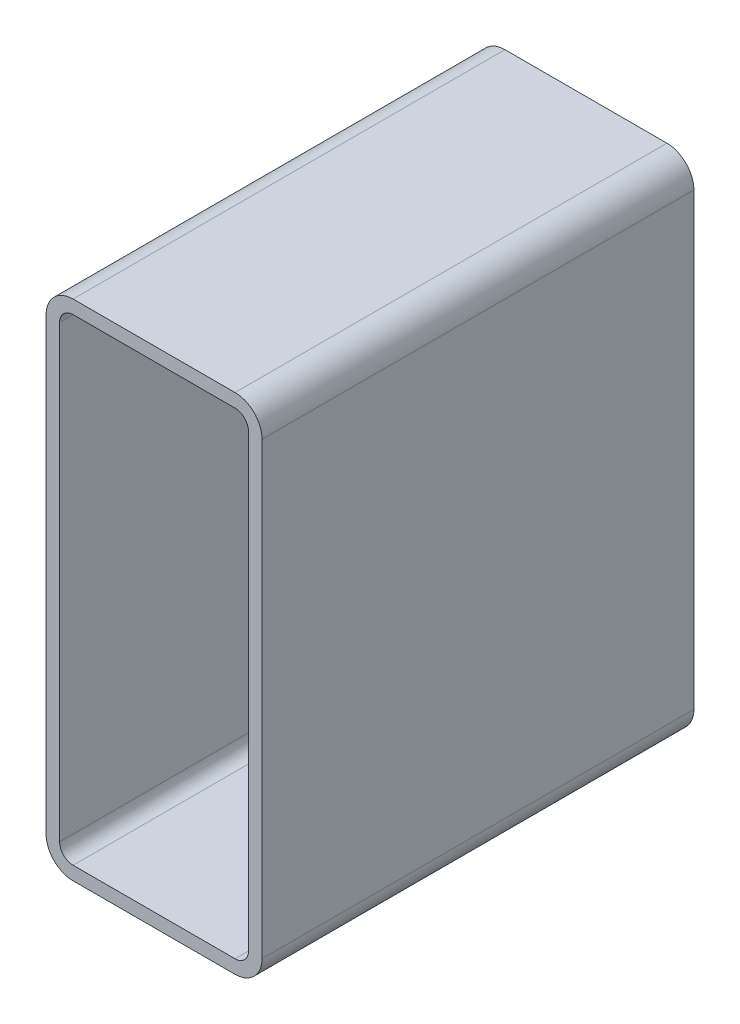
ISO-10303-21;
HEADER;
FILE_DESCRIPTION(('STEP AP214'),'2;1');
FILE_NAME('part.step','',(''),(''),'','','');
FILE_SCHEMA(('AUTOMOTIVE_DESIGN { 1 0 10303 214 1 1 1 1 }'));
ENDSEC;
DATA;
#1=APPLICATION_CONTEXT('core data for automotive mechanical design processes');
#2=APPLICATION_PROTOCOL_DEFINITION('international standard','automotive_design',2000,#1);
#3=PRODUCT_CONTEXT('',#1,'mechanical');
#4=PRODUCT('Part','Part','',(#3));
#5=PRODUCT_RELATED_PRODUCT_CATEGORY('part','',(#4));
#6=PRODUCT_DEFINITION_FORMATION('','',#4);
#7=PRODUCT_DEFINITION_CONTEXT('part definition',#1,'design');
#8=PRODUCT_DEFINITION('design','',#6,#7);
#9=PRODUCT_DEFINITION_SHAPE('','',#8);
#10=(LENGTH_UNIT() NAMED_UNIT(*) SI_UNIT(.MILLI.,.METRE.));
#11=(NAMED_UNIT(*) PLANE_ANGLE_UNIT() SI_UNIT($,.RADIAN.));
#12=(NAMED_UNIT(*) SI_UNIT($,.STERADIAN.) SOLID_ANGLE_UNIT());
#13=UNCERTAINTY_MEASURE_WITH_UNIT(LENGTH_MEASURE(1.E-05),#10,'distance_accuracy_value','');
#14=(GEOMETRIC_REPRESENTATION_CONTEXT(3) GLOBAL_UNCERTAINTY_ASSIGNED_CONTEXT((#13)) GLOBAL_UNIT_ASSIGNED_CONTEXT((#10,
#11,#12)) REPRESENTATION_CONTEXT('',''));
#15=CARTESIAN_POINT('',(0.,0.,0.));
#16=DIRECTION('',(0.,0.,1.));
#17=DIRECTION('',(1.,0.,0.));
#18=AXIS2_PLACEMENT_3D('',#15,#16,#17);
#19=CARTESIAN_POINT('',(19.0973013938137,338.378679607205,304.8));
#20=DIRECTION('',(0.,0.,1.));
#21=DIRECTION('',(1.,0.,0.));
#22=AXIS2_PLACEMENT_3D('',#19,#20,#21);
#23=PLANE('',#22);
#24=CARTESIAN_POINT('',(19.0973013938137,338.378679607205,304.8));
#25=DIRECTION('',(0.,0.,1.));
#26=DIRECTION('',(1.,0.,0.));
#27=AXIS2_PLACEMENT_3D('',#24,#25,#26);
#28=CIRCLE('',#27,19.05);
#29=CARTESIAN_POINT('',(19.0973013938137,357.428679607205,304.8));
#30=VERTEX_POINT('',#29);
#31=CARTESIAN_POINT('',(0.0473013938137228,338.378679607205,304.8));
#32=VERTEX_POINT('',#31);
#33=EDGE_CURVE('E211',#30,#32,#28,.T.);
#34=ORIENTED_EDGE('',*,*,#33,.T.);
#35=DIRECTION('',(0.,-1.,0.));
#36=VECTOR('',#35,1.);
#37=CARTESIAN_POINT('',(0.0473013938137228,20.8786796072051,304.8));
#38=LINE('',#37,#36);
#39=CARTESIAN_POINT('',(0.0473013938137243,20.8786796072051,304.8));
#40=VERTEX_POINT('',#39);
#41=EDGE_CURVE('E214',#32,#40,#38,.T.);
#42=ORIENTED_EDGE('',*,*,#41,.T.);
#43=CARTESIAN_POINT('',(19.0973013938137,20.8786796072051,304.8));
#44=DIRECTION('',(0.,0.,1.));
#45=DIRECTION('',(1.,0.,0.));
#46=AXIS2_PLACEMENT_3D('',#43,#44,#45);
#47=CIRCLE('',#46,19.05);
#48=CARTESIAN_POINT('',(19.0973013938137,1.82867960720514,304.8));
#49=VERTEX_POINT('',#48);
#50=EDGE_CURVE('E217',#40,#49,#47,.T.);
#51=ORIENTED_EDGE('',*,*,#50,.T.);
#52=DIRECTION('',(1.,0.,0.));
#53=VECTOR('',#52,1.);
#54=CARTESIAN_POINT('',(133.397301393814,1.82867960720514,304.8));
#55=LINE('',#54,#53);
#56=CARTESIAN_POINT('',(133.397301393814,1.82867960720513,304.8));
#57=VERTEX_POINT('',#56);
#58=EDGE_CURVE('E219',#49,#57,#55,.T.);
#59=ORIENTED_EDGE('',*,*,#58,.T.);
#60=CARTESIAN_POINT('',(133.397301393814,20.8786796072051,304.8));
#61=DIRECTION('',(0.,0.,1.));
#62=DIRECTION('',(1.,0.,0.));
#63=AXIS2_PLACEMENT_3D('',#60,#61,#62);
#64=CIRCLE('',#63,19.05);
#65=CARTESIAN_POINT('',(152.447301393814,20.8786796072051,304.8));
#66=VERTEX_POINT('',#65);
#67=EDGE_CURVE('E221',#57,#66,#64,.T.);
#68=ORIENTED_EDGE('',*,*,#67,.T.);
#69=DIRECTION('',(0.,1.,0.));
#70=VECTOR('',#69,1.);
#71=CARTESIAN_POINT('',(152.447301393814,338.378679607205,304.8));
#72=LINE('',#71,#70);
#73=CARTESIAN_POINT('',(152.447301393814,338.378679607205,304.8));
#74=VERTEX_POINT('',#73);
#75=EDGE_CURVE('E223',#66,#74,#72,.T.);
#76=ORIENTED_EDGE('',*,*,#75,.T.);
#77=CARTESIAN_POINT('',(133.397301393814,338.378679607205,304.8));
#78=DIRECTION('',(0.,0.,1.));
#79=DIRECTION('',(1.,0.,0.));
#80=AXIS2_PLACEMENT_3D('',#77,#78,#79);
#81=CIRCLE('',#80,19.05);
#82=CARTESIAN_POINT('',(133.397301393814,357.428679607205,304.8));
#83=VERTEX_POINT('',#82);
#84=EDGE_CURVE('E225',#74,#83,#81,.T.);
#85=ORIENTED_EDGE('',*,*,#84,.T.);
#86=DIRECTION('',(-1.,0.,0.));
#87=VECTOR('',#86,1.);
#88=CARTESIAN_POINT('',(19.0973013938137,357.428679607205,304.8));
#89=LINE('',#88,#87);
#90=EDGE_CURVE('E227',#83,#30,#89,.T.);
#91=ORIENTED_EDGE('',*,*,#90,.T.);
#92=EDGE_LOOP('',(#34,#42,#51,#59,#68,#76,#85,#91));
#93=FACE_BOUND('',#92,.T.);
#94=DIRECTION('',(0.,-1.,0.));
#95=VECTOR('',#94,1.);
#96=CARTESIAN_POINT('',(9.57230139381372,20.8786796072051,304.8));
#97=LINE('',#96,#95);
#98=CARTESIAN_POINT('',(9.57230139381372,338.378679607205,304.8));
#99=VERTEX_POINT('',#98);
#100=CARTESIAN_POINT('',(9.57230139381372,20.8786796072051,304.8));
#101=VERTEX_POINT('',#100);
#102=EDGE_CURVE('E154',#99,#101,#97,.T.);
#103=ORIENTED_EDGE('',*,*,#102,.F.);
#104=CARTESIAN_POINT('',(19.0973013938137,338.378679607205,304.8));
#105=DIRECTION('',(0.,0.,1.));
#106=DIRECTION('',(1.,0.,0.));
#107=AXIS2_PLACEMENT_3D('',#104,#105,#106);
#108=CIRCLE('',#107,9.52499999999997);
#109=CARTESIAN_POINT('',(19.0973013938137,347.903679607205,304.8));
#110=VERTEX_POINT('',#109);
#111=EDGE_CURVE('E146',#110,#99,#108,.T.);
#112=ORIENTED_EDGE('',*,*,#111,.F.);
#113=DIRECTION('',(-1.,0.,0.));
#114=VECTOR('',#113,1.);
#115=CARTESIAN_POINT('',(19.0973013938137,347.903679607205,304.8));
#116=LINE('',#115,#114);
#117=CARTESIAN_POINT('',(133.397301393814,347.903679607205,304.8));
#118=VERTEX_POINT('',#117);
#119=EDGE_CURVE('E179',#118,#110,#116,.T.);
#120=ORIENTED_EDGE('',*,*,#119,.F.);
#121=CARTESIAN_POINT('',(133.397301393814,338.378679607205,304.8));
#122=DIRECTION('',(0.,0.,1.));
#123=DIRECTION('',(1.,0.,0.));
#124=AXIS2_PLACEMENT_3D('',#121,#122,#123);
#125=CIRCLE('',#124,9.52499999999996);
#126=CARTESIAN_POINT('',(142.922301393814,338.378679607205,304.8));
#127=VERTEX_POINT('',#126);
#128=EDGE_CURVE('E177',#127,#118,#125,.T.);
#129=ORIENTED_EDGE('',*,*,#128,.F.);
#130=DIRECTION('',(0.,1.,0.));
#131=VECTOR('',#130,1.);
#132=CARTESIAN_POINT('',(142.922301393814,338.378679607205,304.8));
#133=LINE('',#132,#131);
#134=CARTESIAN_POINT('',(142.922301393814,20.8786796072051,304.8));
#135=VERTEX_POINT('',#134);
#136=EDGE_CURVE('E175',#135,#127,#133,.T.);
#137=ORIENTED_EDGE('',*,*,#136,.F.);
#138=CARTESIAN_POINT('',(133.397301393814,20.8786796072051,304.8));
#139=DIRECTION('',(0.,0.,1.));
#140=DIRECTION('',(1.,0.,0.));
#141=AXIS2_PLACEMENT_3D('',#138,#139,#140);
#142=CIRCLE('',#141,9.525);
#143=CARTESIAN_POINT('',(133.397301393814,11.3536796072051,304.8));
#144=VERTEX_POINT('',#143);
#145=EDGE_CURVE('E173',#144,#135,#142,.T.);
#146=ORIENTED_EDGE('',*,*,#145,.F.);
#147=DIRECTION('',(1.,0.,0.));
#148=VECTOR('',#147,1.);
#149=CARTESIAN_POINT('',(133.397301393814,11.3536796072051,304.8));
#150=LINE('',#149,#148);
#151=CARTESIAN_POINT('',(19.0973013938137,11.3536796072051,304.8));
#152=VERTEX_POINT('',#151);
#153=EDGE_CURVE('E169',#152,#144,#150,.T.);
#154=ORIENTED_EDGE('',*,*,#153,.F.);
#155=CARTESIAN_POINT('',(19.0973013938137,20.8786796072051,304.8));
#156=DIRECTION('',(0.,0.,1.));
#157=DIRECTION('',(1.,0.,0.));
#158=AXIS2_PLACEMENT_3D('',#155,#156,#157);
#159=CIRCLE('',#158,9.525);
#160=EDGE_CURVE('E167',#101,#152,#159,.T.);
#161=ORIENTED_EDGE('',*,*,#160,.F.);
#162=EDGE_LOOP('',(#103,#112,#120,#129,#137,#146,#154,#161));
#163=FACE_BOUND('',#162,.T.);
#164=ADVANCED_FACE('F33',(#93,#163),#23,.T.);
#165=CARTESIAN_POINT('',(19.0973013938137,338.378679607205,0.));
#166=DIRECTION('',(0.,0.,1.));
#167=DIRECTION('',(1.,0.,0.));
#168=AXIS2_PLACEMENT_3D('',#165,#166,#167);
#169=PLANE('',#168);
#170=CARTESIAN_POINT('',(19.0973013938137,338.378679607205,0.));
#171=DIRECTION('',(0.,0.,1.));
#172=DIRECTION('',(1.,0.,0.));
#173=AXIS2_PLACEMENT_3D('',#170,#171,#172);
#174=CIRCLE('',#173,19.05);
#175=CARTESIAN_POINT('',(19.0973013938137,357.428679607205,0.));
#176=VERTEX_POINT('',#175);
#177=CARTESIAN_POINT('',(0.0473013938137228,338.378679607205,0.));
#178=VERTEX_POINT('',#177);
#179=EDGE_CURVE('E162',#176,#178,#174,.T.);
#180=ORIENTED_EDGE('',*,*,#179,.F.);
#181=DIRECTION('',(-1.,0.,0.));
#182=VECTOR('',#181,1.);
#183=CARTESIAN_POINT('',(19.0973013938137,357.428679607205,0.));
#184=LINE('',#183,#182);
#185=CARTESIAN_POINT('',(133.397301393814,357.428679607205,0.));
#186=VERTEX_POINT('',#185);
#187=EDGE_CURVE('E215',#186,#176,#184,.T.);
#188=ORIENTED_EDGE('',*,*,#187,.F.);
#189=CARTESIAN_POINT('',(133.397301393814,338.378679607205,0.));
#190=DIRECTION('',(0.,0.,1.));
#191=DIRECTION('',(1.,0.,0.));
#192=AXIS2_PLACEMENT_3D('',#189,#190,#191);
#193=CIRCLE('',#192,19.05);
#194=CARTESIAN_POINT('',(152.447301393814,338.378679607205,0.));
#195=VERTEX_POINT('',#194);
#196=EDGE_CURVE('E242',#195,#186,#193,.T.);
#197=ORIENTED_EDGE('',*,*,#196,.F.);
#198=DIRECTION('',(0.,1.,0.));
#199=VECTOR('',#198,1.);
#200=CARTESIAN_POINT('',(152.447301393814,338.378679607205,0.));
#201=LINE('',#200,#199);
#202=CARTESIAN_POINT('',(152.447301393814,20.8786796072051,0.));
#203=VERTEX_POINT('',#202);
#204=EDGE_CURVE('E240',#203,#195,#201,.T.);
#205=ORIENTED_EDGE('',*,*,#204,.F.);
#206=CARTESIAN_POINT('',(133.397301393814,20.8786796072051,0.));
#207=DIRECTION('',(0.,0.,1.));
#208=DIRECTION('',(1.,0.,0.));
#209=AXIS2_PLACEMENT_3D('',#206,#207,#208);
#210=CIRCLE('',#209,19.05);
#211=CARTESIAN_POINT('',(133.397301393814,1.82867960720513,0.));
#212=VERTEX_POINT('',#211);
#213=EDGE_CURVE('E238',#212,#203,#210,.T.);
#214=ORIENTED_EDGE('',*,*,#213,.F.);
#215=DIRECTION('',(1.,0.,0.));
#216=VECTOR('',#215,1.);
#217=CARTESIAN_POINT('',(133.397301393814,1.82867960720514,0.));
#218=LINE('',#217,#216);
#219=CARTESIAN_POINT('',(19.0973013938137,1.82867960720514,0.));
#220=VERTEX_POINT('',#219);
#221=EDGE_CURVE('E236',#220,#212,#218,.T.);
#222=ORIENTED_EDGE('',*,*,#221,.F.);
#223=CARTESIAN_POINT('',(19.0973013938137,20.8786796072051,0.));
#224=DIRECTION('',(0.,0.,1.));
#225=DIRECTION('',(1.,0.,0.));
#226=AXIS2_PLACEMENT_3D('',#223,#224,#225);
#227=CIRCLE('',#226,19.05);
#228=CARTESIAN_POINT('',(0.0473013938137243,20.8786796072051,0.));
#229=VERTEX_POINT('',#228);
#230=EDGE_CURVE('E234',#229,#220,#227,.T.);
#231=ORIENTED_EDGE('',*,*,#230,.F.);
#232=DIRECTION('',(0.,-1.,0.));
#233=VECTOR('',#232,1.);
#234=CARTESIAN_POINT('',(0.0473013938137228,20.8786796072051,0.));
#235=LINE('',#234,#233);
#236=EDGE_CURVE('E232',#178,#229,#235,.T.);
#237=ORIENTED_EDGE('',*,*,#236,.F.);
#238=EDGE_LOOP('',(#180,#188,#197,#205,#214,#222,#231,#237));
#239=FACE_BOUND('',#238,.T.);
#240=CARTESIAN_POINT('',(19.0973013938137,338.378679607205,0.));
#241=DIRECTION('',(0.,0.,1.));
#242=DIRECTION('',(1.,0.,0.));
#243=AXIS2_PLACEMENT_3D('',#240,#241,#242);
#244=CIRCLE('',#243,9.52499999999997);
#245=CARTESIAN_POINT('',(19.0973013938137,347.903679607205,0.));
#246=VERTEX_POINT('',#245);
#247=CARTESIAN_POINT('',(9.57230139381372,338.378679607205,0.));
#248=VERTEX_POINT('',#247);
#249=EDGE_CURVE('E56',#246,#248,#244,.T.);
#250=ORIENTED_EDGE('',*,*,#249,.T.);
#251=DIRECTION('',(0.,-1.,0.));
#252=VECTOR('',#251,1.);
#253=CARTESIAN_POINT('',(9.57230139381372,20.8786796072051,0.));
#254=LINE('',#253,#252);
#255=CARTESIAN_POINT('',(9.57230139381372,20.8786796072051,0.));
#256=VERTEX_POINT('',#255);
#257=EDGE_CURVE('E161',#248,#256,#254,.T.);
#258=ORIENTED_EDGE('',*,*,#257,.T.);
#259=CARTESIAN_POINT('',(19.0973013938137,20.8786796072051,0.));
#260=DIRECTION('',(0.,0.,1.));
#261=DIRECTION('',(1.,0.,0.));
#262=AXIS2_PLACEMENT_3D('',#259,#260,#261);
#263=CIRCLE('',#262,9.525);
#264=CARTESIAN_POINT('',(19.0973013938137,11.3536796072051,0.));
#265=VERTEX_POINT('',#264);
#266=EDGE_CURVE('E183',#256,#265,#263,.T.);
#267=ORIENTED_EDGE('',*,*,#266,.T.);
#268=DIRECTION('',(1.,0.,0.));
#269=VECTOR('',#268,1.);
#270=CARTESIAN_POINT('',(133.397301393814,11.3536796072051,0.));
#271=LINE('',#270,#269);
#272=CARTESIAN_POINT('',(133.397301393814,11.3536796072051,0.));
#273=VERTEX_POINT('',#272);
#274=EDGE_CURVE('E186',#265,#273,#271,.T.);
#275=ORIENTED_EDGE('',*,*,#274,.T.);
#276=CARTESIAN_POINT('',(133.397301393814,20.8786796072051,0.));
#277=DIRECTION('',(0.,0.,1.));
#278=DIRECTION('',(1.,0.,0.));
#279=AXIS2_PLACEMENT_3D('',#276,#277,#278);
#280=CIRCLE('',#279,9.525);
#281=CARTESIAN_POINT('',(142.922301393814,20.8786796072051,0.));
#282=VERTEX_POINT('',#281);
#283=EDGE_CURVE('E189',#273,#282,#280,.T.);
#284=ORIENTED_EDGE('',*,*,#283,.T.);
#285=DIRECTION('',(0.,1.,0.));
#286=VECTOR('',#285,1.);
#287=CARTESIAN_POINT('',(142.922301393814,338.378679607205,0.));
#288=LINE('',#287,#286);
#289=CARTESIAN_POINT('',(142.922301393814,338.378679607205,0.));
#290=VERTEX_POINT('',#289);
#291=EDGE_CURVE('E192',#282,#290,#288,.T.);
#292=ORIENTED_EDGE('',*,*,#291,.T.);
#293=CARTESIAN_POINT('',(133.397301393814,338.378679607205,0.));
#294=DIRECTION('',(0.,0.,1.));
#295=DIRECTION('',(1.,0.,0.));
#296=AXIS2_PLACEMENT_3D('',#293,#294,#295);
#297=CIRCLE('',#296,9.52499999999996);
#298=CARTESIAN_POINT('',(133.397301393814,347.903679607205,0.));
#299=VERTEX_POINT('',#298);
#300=EDGE_CURVE('E195',#290,#299,#297,.T.);
#301=ORIENTED_EDGE('',*,*,#300,.T.);
#302=DIRECTION('',(-1.,0.,0.));
#303=VECTOR('',#302,1.);
#304=CARTESIAN_POINT('',(19.0973013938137,347.903679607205,0.));
#305=LINE('',#304,#303);
#306=EDGE_CURVE('E155',#299,#246,#305,.T.);
#307=ORIENTED_EDGE('',*,*,#306,.T.);
#308=EDGE_LOOP('',(#250,#258,#267,#275,#284,#292,#301,#307));
#309=FACE_BOUND('',#308,.T.);
#310=ADVANCED_FACE('F272',(#239,#309),#169,.F.);
#311=CARTESIAN_POINT('',(19.0973013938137,338.378679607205,304.8));
#312=DIRECTION('',(0.,0.,-1.));
#313=DIRECTION('',(-1.,0.,0.));
#314=AXIS2_PLACEMENT_3D('',#311,#312,#313);
#315=CYLINDRICAL_SURFACE('',#314,19.05);
#316=ORIENTED_EDGE('',*,*,#179,.T.);
#317=DIRECTION('',(0.,0.,-1.));
#318=VECTOR('',#317,1.);
#319=CARTESIAN_POINT('',(0.0473013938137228,338.378679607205,304.8));
#320=LINE('',#319,#318);
#321=EDGE_CURVE('E11',#32,#178,#320,.T.);
#322=ORIENTED_EDGE('',*,*,#321,.F.);
#323=ORIENTED_EDGE('',*,*,#33,.F.);
#324=DIRECTION('',(0.,0.,-1.));
#325=VECTOR('',#324,1.);
#326=CARTESIAN_POINT('',(19.0973013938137,357.428679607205,304.8));
#327=LINE('',#326,#325);
#328=EDGE_CURVE('E229',#30,#176,#327,.T.);
#329=ORIENTED_EDGE('',*,*,#328,.T.);
#330=EDGE_LOOP('',(#316,#322,#323,#329));
#331=FACE_BOUND('',#330,.T.);
#332=ADVANCED_FACE('F35',(#331),#315,.T.);
#333=CARTESIAN_POINT('',(0.0473013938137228,20.8786796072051,304.8));
#334=DIRECTION('',(1.,0.,0.));
#335=DIRECTION('',(0.,0.,-1.));
#336=AXIS2_PLACEMENT_3D('',#333,#334,#335);
#337=PLANE('',#336);
#338=ORIENTED_EDGE('',*,*,#236,.T.);
#339=DIRECTION('',(0.,0.,-1.));
#340=VECTOR('',#339,1.);
#341=CARTESIAN_POINT('',(0.0473013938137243,20.8786796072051,304.8));
#342=LINE('',#341,#340);
#343=EDGE_CURVE('E41',#40,#229,#342,.T.);
#344=ORIENTED_EDGE('',*,*,#343,.F.);
#345=ORIENTED_EDGE('',*,*,#41,.F.);
#346=ORIENTED_EDGE('',*,*,#321,.T.);
#347=EDGE_LOOP('',(#338,#344,#345,#346));
#348=FACE_BOUND('',#347,.T.);
#349=ADVANCED_FACE('F289',(#348),#337,.F.);
#350=CARTESIAN_POINT('',(19.0973013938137,20.8786796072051,304.8));
#351=DIRECTION('',(0.,0.,-1.));
#352=DIRECTION('',(-1.,0.,0.));
#353=AXIS2_PLACEMENT_3D('',#350,#351,#352);
#354=CYLINDRICAL_SURFACE('',#353,19.05);
#355=ORIENTED_EDGE('',*,*,#230,.T.);
#356=DIRECTION('',(0.,0.,-1.));
#357=VECTOR('',#356,1.);
#358=CARTESIAN_POINT('',(19.0973013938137,1.82867960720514,304.8));
#359=LINE('',#358,#357);
#360=EDGE_CURVE('E259',#49,#220,#359,.T.);
#361=ORIENTED_EDGE('',*,*,#360,.F.);
#362=ORIENTED_EDGE('',*,*,#50,.F.);
#363=ORIENTED_EDGE('',*,*,#343,.T.);
#364=EDGE_LOOP('',(#355,#361,#362,#363));
#365=FACE_BOUND('',#364,.T.);
#366=ADVANCED_FACE('F266',(#365),#354,.T.);
#367=CARTESIAN_POINT('',(133.397301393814,1.82867960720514,304.8));
#368=DIRECTION('',(0.,1.,0.));
#369=DIRECTION('',(0.,0.,1.));
#370=AXIS2_PLACEMENT_3D('',#367,#368,#369);
#371=PLANE('',#370);
#372=ORIENTED_EDGE('',*,*,#221,.T.);
#373=DIRECTION('',(0.,0.,-1.));
#374=VECTOR('',#373,1.);
#375=CARTESIAN_POINT('',(133.397301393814,1.82867960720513,304.8));
#376=LINE('',#375,#374);
#377=EDGE_CURVE('E256',#57,#212,#376,.T.);
#378=ORIENTED_EDGE('',*,*,#377,.F.);
#379=ORIENTED_EDGE('',*,*,#58,.F.);
#380=ORIENTED_EDGE('',*,*,#360,.T.);
#381=EDGE_LOOP('',(#372,#378,#379,#380));
#382=FACE_BOUND('',#381,.T.);
#383=ADVANCED_FACE('F278',(#382),#371,.F.);
#384=CARTESIAN_POINT('',(133.397301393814,20.8786796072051,304.8));
#385=DIRECTION('',(0.,0.,-1.));
#386=DIRECTION('',(-1.,0.,0.));
#387=AXIS2_PLACEMENT_3D('',#384,#385,#386);
#388=CYLINDRICAL_SURFACE('',#387,19.05);
#389=ORIENTED_EDGE('',*,*,#213,.T.);
#390=DIRECTION('',(0.,0.,-1.));
#391=VECTOR('',#390,1.);
#392=CARTESIAN_POINT('',(152.447301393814,20.8786796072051,304.8));
#393=LINE('',#392,#391);
#394=EDGE_CURVE('E253',#66,#203,#393,.T.);
#395=ORIENTED_EDGE('',*,*,#394,.F.);
#396=ORIENTED_EDGE('',*,*,#67,.F.);
#397=ORIENTED_EDGE('',*,*,#377,.T.);
#398=EDGE_LOOP('',(#389,#395,#396,#397));
#399=FACE_BOUND('',#398,.T.);
#400=ADVANCED_FACE('F282',(#399),#388,.T.);
#401=CARTESIAN_POINT('',(152.447301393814,338.378679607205,304.8));
#402=DIRECTION('',(-1.,0.,0.));
#403=DIRECTION('',(0.,0.,1.));
#404=AXIS2_PLACEMENT_3D('',#401,#402,#403);
#405=PLANE('',#404);
#406=ORIENTED_EDGE('',*,*,#204,.T.);
#407=DIRECTION('',(0.,0.,-1.));
#408=VECTOR('',#407,1.);
#409=CARTESIAN_POINT('',(152.447301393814,338.378679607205,304.8));
#410=LINE('',#409,#408);
#411=EDGE_CURVE('E250',#74,#195,#410,.T.);
#412=ORIENTED_EDGE('',*,*,#411,.F.);
#413=ORIENTED_EDGE('',*,*,#75,.F.);
#414=ORIENTED_EDGE('',*,*,#394,.T.);
#415=EDGE_LOOP('',(#406,#412,#413,#414));
#416=FACE_BOUND('',#415,.T.);
#417=ADVANCED_FACE('F302',(#416),#405,.F.);
#418=CARTESIAN_POINT('',(133.397301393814,338.378679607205,304.8));
#419=DIRECTION('',(0.,0.,-1.));
#420=DIRECTION('',(-1.,0.,0.));
#421=AXIS2_PLACEMENT_3D('',#418,#419,#420);
#422=CYLINDRICAL_SURFACE('',#421,19.05);
#423=ORIENTED_EDGE('',*,*,#196,.T.);
#424=DIRECTION('',(0.,0.,-1.));
#425=VECTOR('',#424,1.);
#426=CARTESIAN_POINT('',(133.397301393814,357.428679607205,304.8));
#427=LINE('',#426,#425);
#428=EDGE_CURVE('E247',#83,#186,#427,.T.);
#429=ORIENTED_EDGE('',*,*,#428,.F.);
#430=ORIENTED_EDGE('',*,*,#84,.F.);
#431=ORIENTED_EDGE('',*,*,#411,.T.);
#432=EDGE_LOOP('',(#423,#429,#430,#431));
#433=FACE_BOUND('',#432,.T.);
#434=ADVANCED_FACE('F300',(#433),#422,.T.);
#435=CARTESIAN_POINT('',(19.0973013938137,357.428679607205,304.8));
#436=DIRECTION('',(0.,-1.,0.));
#437=DIRECTION('',(0.,0.,-1.));
#438=AXIS2_PLACEMENT_3D('',#435,#436,#437);
#439=PLANE('',#438);
#440=ORIENTED_EDGE('',*,*,#187,.T.);
#441=ORIENTED_EDGE('',*,*,#328,.F.);
#442=ORIENTED_EDGE('',*,*,#90,.F.);
#443=ORIENTED_EDGE('',*,*,#428,.T.);
#444=EDGE_LOOP('',(#440,#441,#442,#443));
#445=FACE_BOUND('',#444,.T.);
#446=ADVANCED_FACE('F295',(#445),#439,.F.);
#447=CARTESIAN_POINT('',(19.0973013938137,338.378679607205,304.8));
#448=DIRECTION('',(0.,0.,-1.));
#449=DIRECTION('',(-1.,0.,0.));
#450=AXIS2_PLACEMENT_3D('',#447,#448,#449);
#451=CYLINDRICAL_SURFACE('',#450,9.52499999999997);
#452=ORIENTED_EDGE('',*,*,#249,.F.);
#453=DIRECTION('',(0.,0.,-1.));
#454=VECTOR('',#453,1.);
#455=CARTESIAN_POINT('',(19.0973013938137,347.903679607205,304.8));
#456=LINE('',#455,#454);
#457=EDGE_CURVE('E150',#110,#246,#456,.T.);
#458=ORIENTED_EDGE('',*,*,#457,.F.);
#459=ORIENTED_EDGE('',*,*,#111,.T.);
#460=DIRECTION('',(0.,0.,-1.));
#461=VECTOR('',#460,1.);
#462=CARTESIAN_POINT('',(9.57230139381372,338.378679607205,304.8));
#463=LINE('',#462,#461);
#464=EDGE_CURVE('E149',#99,#248,#463,.T.);
#465=ORIENTED_EDGE('',*,*,#464,.T.);
#466=EDGE_LOOP('',(#452,#458,#459,#465));
#467=FACE_BOUND('',#466,.T.);
#468=ADVANCED_FACE('F148',(#467),#451,.F.);
#469=CARTESIAN_POINT('',(9.57230139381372,20.8786796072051,304.8));
#470=DIRECTION('',(1.,0.,0.));
#471=DIRECTION('',(0.,0.,-1.));
#472=AXIS2_PLACEMENT_3D('',#469,#470,#471);
#473=PLANE('',#472);
#474=ORIENTED_EDGE('',*,*,#257,.F.);
#475=ORIENTED_EDGE('',*,*,#464,.F.);
#476=ORIENTED_EDGE('',*,*,#102,.T.);
#477=DIRECTION('',(0.,0.,-1.));
#478=VECTOR('',#477,1.);
#479=CARTESIAN_POINT('',(9.57230139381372,20.8786796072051,304.8));
#480=LINE('',#479,#478);
#481=EDGE_CURVE('E163',#101,#256,#480,.T.);
#482=ORIENTED_EDGE('',*,*,#481,.T.);
#483=EDGE_LOOP('',(#474,#475,#476,#482));
#484=FACE_BOUND('',#483,.T.);
#485=ADVANCED_FACE('F158',(#484),#473,.T.);
#486=CARTESIAN_POINT('',(19.0973013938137,20.8786796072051,304.8));
#487=DIRECTION('',(0.,0.,-1.));
#488=DIRECTION('',(-1.,0.,0.));
#489=AXIS2_PLACEMENT_3D('',#486,#487,#488);
#490=CYLINDRICAL_SURFACE('',#489,9.525);
#491=ORIENTED_EDGE('',*,*,#266,.F.);
#492=ORIENTED_EDGE('',*,*,#481,.F.);
#493=ORIENTED_EDGE('',*,*,#160,.T.);
#494=DIRECTION('',(0.,0.,-1.));
#495=VECTOR('',#494,1.);
#496=CARTESIAN_POINT('',(19.0973013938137,11.3536796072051,304.8));
#497=LINE('',#496,#495);
#498=EDGE_CURVE('E208',#152,#265,#497,.T.);
#499=ORIENTED_EDGE('',*,*,#498,.T.);
#500=EDGE_LOOP('',(#491,#492,#493,#499));
#501=FACE_BOUND('',#500,.T.);
#502=ADVANCED_FACE('F327',(#501),#490,.F.);
#503=CARTESIAN_POINT('',(133.397301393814,11.3536796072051,304.8));
#504=DIRECTION('',(0.,1.,0.));
#505=DIRECTION('',(0.,0.,1.));
#506=AXIS2_PLACEMENT_3D('',#503,#504,#505);
#507=PLANE('',#506);
#508=ORIENTED_EDGE('',*,*,#274,.F.);
#509=ORIENTED_EDGE('',*,*,#498,.F.);
#510=ORIENTED_EDGE('',*,*,#153,.T.);
#511=DIRECTION('',(0.,0.,-1.));
#512=VECTOR('',#511,1.);
#513=CARTESIAN_POINT('',(133.397301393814,11.3536796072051,304.8));
#514=LINE('',#513,#512);
#515=EDGE_CURVE('E206',#144,#273,#514,.T.);
#516=ORIENTED_EDGE('',*,*,#515,.T.);
#517=EDGE_LOOP('',(#508,#509,#510,#516));
#518=FACE_BOUND('',#517,.T.);
#519=ADVANCED_FACE('F331',(#518),#507,.T.);
#520=CARTESIAN_POINT('',(133.397301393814,20.8786796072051,304.8));
#521=DIRECTION('',(0.,0.,-1.));
#522=DIRECTION('',(-1.,0.,0.));
#523=AXIS2_PLACEMENT_3D('',#520,#521,#522);
#524=CYLINDRICAL_SURFACE('',#523,9.525);
#525=ORIENTED_EDGE('',*,*,#283,.F.);
#526=ORIENTED_EDGE('',*,*,#515,.F.);
#527=ORIENTED_EDGE('',*,*,#145,.T.);
#528=DIRECTION('',(0.,0.,-1.));
#529=VECTOR('',#528,1.);
#530=CARTESIAN_POINT('',(142.922301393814,20.8786796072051,304.8));
#531=LINE('',#530,#529);
#532=EDGE_CURVE('E204',#135,#282,#531,.T.);
#533=ORIENTED_EDGE('',*,*,#532,.T.);
#534=EDGE_LOOP('',(#525,#526,#527,#533));
#535=FACE_BOUND('',#534,.T.);
#536=ADVANCED_FACE('F337',(#535),#524,.F.);
#537=CARTESIAN_POINT('',(142.922301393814,338.378679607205,304.8));
#538=DIRECTION('',(-1.,0.,0.));
#539=DIRECTION('',(0.,0.,1.));
#540=AXIS2_PLACEMENT_3D('',#537,#538,#539);
#541=PLANE('',#540);
#542=ORIENTED_EDGE('',*,*,#291,.F.);
#543=ORIENTED_EDGE('',*,*,#532,.F.);
#544=ORIENTED_EDGE('',*,*,#136,.T.);
#545=DIRECTION('',(0.,0.,-1.));
#546=VECTOR('',#545,1.);
#547=CARTESIAN_POINT('',(142.922301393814,338.378679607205,304.8));
#548=LINE('',#547,#546);
#549=EDGE_CURVE('E202',#127,#290,#548,.T.);
#550=ORIENTED_EDGE('',*,*,#549,.T.);
#551=EDGE_LOOP('',(#542,#543,#544,#550));
#552=FACE_BOUND('',#551,.T.);
#553=ADVANCED_FACE('F341',(#552),#541,.T.);
#554=CARTESIAN_POINT('',(133.397301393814,338.378679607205,304.8));
#555=DIRECTION('',(0.,0.,-1.));
#556=DIRECTION('',(-1.,0.,0.));
#557=AXIS2_PLACEMENT_3D('',#554,#555,#556);
#558=CYLINDRICAL_SURFACE('',#557,9.52499999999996);
#559=ORIENTED_EDGE('',*,*,#300,.F.);
#560=ORIENTED_EDGE('',*,*,#549,.F.);
#561=ORIENTED_EDGE('',*,*,#128,.T.);
#562=DIRECTION('',(0.,0.,-1.));
#563=VECTOR('',#562,1.);
#564=CARTESIAN_POINT('',(133.397301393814,347.903679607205,304.8));
#565=LINE('',#564,#563);
#566=EDGE_CURVE('E48',#118,#299,#565,.T.);
#567=ORIENTED_EDGE('',*,*,#566,.T.);
#568=EDGE_LOOP('',(#559,#560,#561,#567));
#569=FACE_BOUND('',#568,.T.);
#570=ADVANCED_FACE('F345',(#569),#558,.F.);
#571=CARTESIAN_POINT('',(19.0973013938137,347.903679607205,304.8));
#572=DIRECTION('',(0.,-1.,0.));
#573=DIRECTION('',(0.,0.,-1.));
#574=AXIS2_PLACEMENT_3D('',#571,#572,#573);
#575=PLANE('',#574);
#576=ORIENTED_EDGE('',*,*,#306,.F.);
#577=ORIENTED_EDGE('',*,*,#566,.F.);
#578=ORIENTED_EDGE('',*,*,#119,.T.);
#579=ORIENTED_EDGE('',*,*,#457,.T.);
#580=EDGE_LOOP('',(#576,#577,#578,#579));
#581=FACE_BOUND('',#580,.T.);
#582=ADVANCED_FACE('F349',(#581),#575,.T.);
#583=CLOSED_SHELL('',(#164,#310,#332,#349,#366,#383,#400,#417,#434,#446,#468,#485,#502,#519,
#536,#553,#570,#582));
#584=MANIFOLD_SOLID_BREP('B2',#583);
#585=ADVANCED_BREP_SHAPE_REPRESENTATION('',(#18,#584),#14);
#586=SHAPE_DEFINITION_REPRESENTATION(#9,#585);
ENDSEC;
END-ISO-10303-21;
